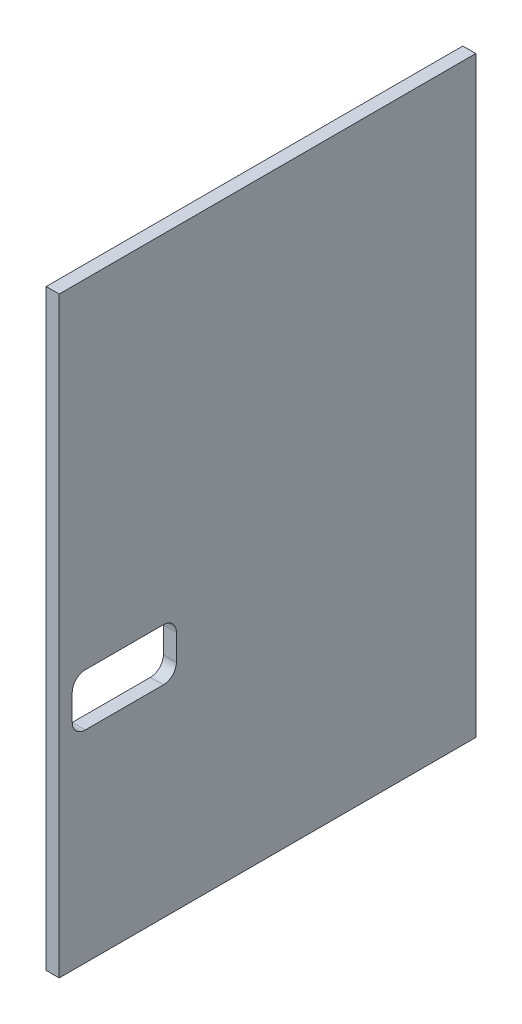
ISO-10303-21;
HEADER;
FILE_DESCRIPTION(('STEP AP214'),'2;1');
FILE_NAME('part.step','',(''),(''),'','','');
FILE_SCHEMA(('AUTOMOTIVE_DESIGN { 1 0 10303 214 1 1 1 1 }'));
ENDSEC;
DATA;
#1=APPLICATION_CONTEXT('core data for automotive mechanical design processes');
#2=APPLICATION_PROTOCOL_DEFINITION('international standard','automotive_design',2000,#1);
#3=PRODUCT_CONTEXT('',#1,'mechanical');
#4=PRODUCT('Part','Part','',(#3));
#5=PRODUCT_RELATED_PRODUCT_CATEGORY('part','',(#4));
#6=PRODUCT_DEFINITION_FORMATION('','',#4);
#7=PRODUCT_DEFINITION_CONTEXT('part definition',#1,'design');
#8=PRODUCT_DEFINITION('design','',#6,#7);
#9=PRODUCT_DEFINITION_SHAPE('','',#8);
#10=(LENGTH_UNIT() NAMED_UNIT(*) SI_UNIT(.MILLI.,.METRE.));
#11=(NAMED_UNIT(*) PLANE_ANGLE_UNIT() SI_UNIT($,.RADIAN.));
#12=(NAMED_UNIT(*) SI_UNIT($,.STERADIAN.) SOLID_ANGLE_UNIT());
#13=UNCERTAINTY_MEASURE_WITH_UNIT(LENGTH_MEASURE(1.E-05),#10,'distance_accuracy_value','');
#14=(GEOMETRIC_REPRESENTATION_CONTEXT(3) GLOBAL_UNCERTAINTY_ASSIGNED_CONTEXT((#13)) GLOBAL_UNIT_ASSIGNED_CONTEXT((#10,
#11,#12)) REPRESENTATION_CONTEXT('',''));
#15=CARTESIAN_POINT('',(0.,0.,0.));
#16=DIRECTION('',(0.,0.,1.));
#17=DIRECTION('',(1.,0.,0.));
#18=AXIS2_PLACEMENT_3D('',#15,#16,#17);
#19=CARTESIAN_POINT('',(25.4,0.,0.));
#20=DIRECTION('',(0.,0.,-1.));
#21=DIRECTION('',(-1.,0.,0.));
#22=AXIS2_PLACEMENT_3D('',#19,#20,#21);
#23=PLANE('',#22);
#24=DIRECTION('',(0.,-1.,0.));
#25=VECTOR('',#24,1.);
#26=CARTESIAN_POINT('',(0.,0.,0.));
#27=LINE('',#26,#25);
#28=CARTESIAN_POINT('',(0.,1155.7,0.));
#29=VERTEX_POINT('',#28);
#30=CARTESIAN_POINT('',(0.,0.,0.));
#31=VERTEX_POINT('',#30);
#32=EDGE_CURVE('E128',#29,#31,#27,.T.);
#33=ORIENTED_EDGE('',*,*,#32,.T.);
#34=DIRECTION('',(-1.,0.,0.));
#35=VECTOR('',#34,1.);
#36=CARTESIAN_POINT('',(25.4,0.,0.));
#37=LINE('',#36,#35);
#38=CARTESIAN_POINT('',(25.4,0.,0.));
#39=VERTEX_POINT('',#38);
#40=EDGE_CURVE('E11',#39,#31,#37,.T.);
#41=ORIENTED_EDGE('',*,*,#40,.F.);
#42=DIRECTION('',(0.,-1.,0.));
#43=VECTOR('',#42,1.);
#44=CARTESIAN_POINT('',(25.4,0.,0.));
#45=LINE('',#44,#43);
#46=CARTESIAN_POINT('',(25.4,1155.7,0.));
#47=VERTEX_POINT('',#46);
#48=EDGE_CURVE('E178',#47,#39,#45,.T.);
#49=ORIENTED_EDGE('',*,*,#48,.F.);
#50=DIRECTION('',(-1.,0.,0.));
#51=VECTOR('',#50,1.);
#52=CARTESIAN_POINT('',(25.4,1155.7,0.));
#53=LINE('',#52,#51);
#54=EDGE_CURVE('E188',#47,#29,#53,.T.);
#55=ORIENTED_EDGE('',*,*,#54,.T.);
#56=EDGE_LOOP('',(#33,#41,#49,#55));
#57=FACE_BOUND('',#56,.T.);
#58=ADVANCED_FACE('F34',(#57),#23,.F.);
#59=CARTESIAN_POINT('',(25.4,0.,0.));
#60=DIRECTION('',(0.,1.,0.));
#61=DIRECTION('',(0.,0.,1.));
#62=AXIS2_PLACEMENT_3D('',#59,#60,#61);
#63=PLANE('',#62);
#64=DIRECTION('',(0.,0.,-1.));
#65=VECTOR('',#64,1.);
#66=CARTESIAN_POINT('',(0.,0.,0.));
#67=LINE('',#66,#65);
#68=CARTESIAN_POINT('',(0.,0.,-812.8));
#69=VERTEX_POINT('',#68);
#70=EDGE_CURVE('E191',#31,#69,#67,.T.);
#71=ORIENTED_EDGE('',*,*,#70,.T.);
#72=DIRECTION('',(-1.,0.,0.));
#73=VECTOR('',#72,1.);
#74=CARTESIAN_POINT('',(25.4,0.,-812.8));
#75=LINE('',#74,#73);
#76=CARTESIAN_POINT('',(25.4,0.,-812.8));
#77=VERTEX_POINT('',#76);
#78=EDGE_CURVE('E41',#77,#69,#75,.T.);
#79=ORIENTED_EDGE('',*,*,#78,.F.);
#80=DIRECTION('',(0.,0.,-1.));
#81=VECTOR('',#80,1.);
#82=CARTESIAN_POINT('',(25.4,0.,0.));
#83=LINE('',#82,#81);
#84=EDGE_CURVE('E181',#39,#77,#83,.T.);
#85=ORIENTED_EDGE('',*,*,#84,.F.);
#86=ORIENTED_EDGE('',*,*,#40,.T.);
#87=EDGE_LOOP('',(#71,#79,#85,#86));
#88=FACE_BOUND('',#87,.T.);
#89=ADVANCED_FACE('F219',(#88),#63,.F.);
#90=CARTESIAN_POINT('',(25.4,0.,-812.8));
#91=DIRECTION('',(0.,0.,1.));
#92=DIRECTION('',(1.,0.,0.));
#93=AXIS2_PLACEMENT_3D('',#90,#91,#92);
#94=PLANE('',#93);
#95=DIRECTION('',(0.,1.,0.));
#96=VECTOR('',#95,1.);
#97=CARTESIAN_POINT('',(0.,0.,-812.8));
#98=LINE('',#97,#96);
#99=CARTESIAN_POINT('',(0.,1155.7,-812.8));
#100=VERTEX_POINT('',#99);
#101=EDGE_CURVE('E193',#69,#100,#98,.T.);
#102=ORIENTED_EDGE('',*,*,#101,.T.);
#103=DIRECTION('',(-1.,0.,0.));
#104=VECTOR('',#103,1.);
#105=CARTESIAN_POINT('',(25.4,1155.7,-812.8));
#106=LINE('',#105,#104);
#107=CARTESIAN_POINT('',(25.4,1155.7,-812.8));
#108=VERTEX_POINT('',#107);
#109=EDGE_CURVE('E198',#108,#100,#106,.T.);
#110=ORIENTED_EDGE('',*,*,#109,.F.);
#111=DIRECTION('',(0.,1.,0.));
#112=VECTOR('',#111,1.);
#113=CARTESIAN_POINT('',(25.4,0.,-812.8));
#114=LINE('',#113,#112);
#115=EDGE_CURVE('E184',#77,#108,#114,.T.);
#116=ORIENTED_EDGE('',*,*,#115,.F.);
#117=ORIENTED_EDGE('',*,*,#78,.T.);
#118=EDGE_LOOP('',(#102,#110,#116,#117));
#119=FACE_BOUND('',#118,.T.);
#120=ADVANCED_FACE('F205',(#119),#94,.F.);
#121=CARTESIAN_POINT('',(25.4,1155.7,0.));
#122=DIRECTION('',(0.,-1.,0.));
#123=DIRECTION('',(0.,0.,-1.));
#124=AXIS2_PLACEMENT_3D('',#121,#122,#123);
#125=PLANE('',#124);
#126=DIRECTION('',(0.,0.,1.));
#127=VECTOR('',#126,1.);
#128=CARTESIAN_POINT('',(0.,1155.7,0.));
#129=LINE('',#128,#127);
#130=EDGE_CURVE('E182',#100,#29,#129,.T.);
#131=ORIENTED_EDGE('',*,*,#130,.T.);
#132=ORIENTED_EDGE('',*,*,#54,.F.);
#133=DIRECTION('',(0.,0.,1.));
#134=VECTOR('',#133,1.);
#135=CARTESIAN_POINT('',(25.4,1155.7,0.));
#136=LINE('',#135,#134);
#137=EDGE_CURVE('E186',#108,#47,#136,.T.);
#138=ORIENTED_EDGE('',*,*,#137,.F.);
#139=ORIENTED_EDGE('',*,*,#109,.T.);
#140=EDGE_LOOP('',(#131,#132,#138,#139));
#141=FACE_BOUND('',#140,.T.);
#142=ADVANCED_FACE('F212',(#141),#125,.F.);
#143=CARTESIAN_POINT('',(25.4,0.,0.));
#144=DIRECTION('',(-1.,0.,0.));
#145=DIRECTION('',(0.,0.,1.));
#146=AXIS2_PLACEMENT_3D('',#143,#144,#145);
#147=PLANE('',#146);
#148=DIRECTION('',(0.,0.,1.));
#149=VECTOR('',#148,1.);
#150=CARTESIAN_POINT('',(25.4,495.300000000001,-50.8));
#151=LINE('',#150,#149);
#152=CARTESIAN_POINT('',(25.4,495.300000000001,-203.2));
#153=VERTEX_POINT('',#152);
#154=CARTESIAN_POINT('',(25.4,495.300000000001,-50.8));
#155=VERTEX_POINT('',#154);
#156=EDGE_CURVE('E142',#153,#155,#151,.T.);
#157=ORIENTED_EDGE('',*,*,#156,.F.);
#158=CARTESIAN_POINT('',(25.4,469.900000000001,-203.2));
#159=DIRECTION('',(1.,0.,0.));
#160=DIRECTION('',(0.,0.,1.));
#161=AXIS2_PLACEMENT_3D('',#158,#159,#160);
#162=CIRCLE('',#161,25.4);
#163=CARTESIAN_POINT('',(25.4,469.900000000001,-228.6));
#164=VERTEX_POINT('',#163);
#165=EDGE_CURVE('E48',#164,#153,#162,.T.);
#166=ORIENTED_EDGE('',*,*,#165,.F.);
#167=DIRECTION('',(0.,1.,0.));
#168=VECTOR('',#167,1.);
#169=CARTESIAN_POINT('',(25.4,469.900000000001,-228.6));
#170=LINE('',#169,#168);
#171=CARTESIAN_POINT('',(25.4,419.100000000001,-228.6));
#172=VERTEX_POINT('',#171);
#173=EDGE_CURVE('E134',#172,#164,#170,.T.);
#174=ORIENTED_EDGE('',*,*,#173,.F.);
#175=CARTESIAN_POINT('',(25.4,419.100000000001,-203.2));
#176=DIRECTION('',(1.,0.,0.));
#177=DIRECTION('',(0.,0.,-1.));
#178=AXIS2_PLACEMENT_3D('',#175,#176,#177);
#179=CIRCLE('',#178,25.4);
#180=CARTESIAN_POINT('',(25.4,393.700000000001,-203.2));
#181=VERTEX_POINT('',#180);
#182=EDGE_CURVE('E161',#181,#172,#179,.T.);
#183=ORIENTED_EDGE('',*,*,#182,.F.);
#184=DIRECTION('',(0.,0.,-1.));
#185=VECTOR('',#184,1.);
#186=CARTESIAN_POINT('',(25.4,393.700000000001,-50.8));
#187=LINE('',#186,#185);
#188=CARTESIAN_POINT('',(25.4,393.700000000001,-50.8));
#189=VERTEX_POINT('',#188);
#190=EDGE_CURVE('E158',#189,#181,#187,.T.);
#191=ORIENTED_EDGE('',*,*,#190,.F.);
#192=CARTESIAN_POINT('',(25.4,419.100000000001,-50.8));
#193=DIRECTION('',(1.,0.,0.));
#194=DIRECTION('',(0.,0.,-1.));
#195=AXIS2_PLACEMENT_3D('',#192,#193,#194);
#196=CIRCLE('',#195,25.4);
#197=CARTESIAN_POINT('',(25.4,419.100000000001,-25.4));
#198=VERTEX_POINT('',#197);
#199=EDGE_CURVE('E155',#198,#189,#196,.T.);
#200=ORIENTED_EDGE('',*,*,#199,.F.);
#201=DIRECTION('',(0.,-1.,0.));
#202=VECTOR('',#201,1.);
#203=CARTESIAN_POINT('',(25.4,469.900000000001,-25.4));
#204=LINE('',#203,#202);
#205=CARTESIAN_POINT('',(25.4,469.900000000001,-25.4));
#206=VERTEX_POINT('',#205);
#207=EDGE_CURVE('E152',#206,#198,#204,.T.);
#208=ORIENTED_EDGE('',*,*,#207,.F.);
#209=CARTESIAN_POINT('',(25.4,469.900000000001,-50.8));
#210=DIRECTION('',(1.,0.,0.));
#211=DIRECTION('',(0.,0.,-1.));
#212=AXIS2_PLACEMENT_3D('',#209,#210,#211);
#213=CIRCLE('',#212,25.4);
#214=EDGE_CURVE('E149',#155,#206,#213,.T.);
#215=ORIENTED_EDGE('',*,*,#214,.F.);
#216=EDGE_LOOP('',(#157,#166,#174,#183,#191,#200,#208,#215));
#217=FACE_BOUND('',#216,.T.);
#218=ORIENTED_EDGE('',*,*,#48,.T.);
#219=ORIENTED_EDGE('',*,*,#84,.T.);
#220=ORIENTED_EDGE('',*,*,#115,.T.);
#221=ORIENTED_EDGE('',*,*,#137,.T.);
#222=EDGE_LOOP('',(#218,#219,#220,#221));
#223=FACE_BOUND('',#222,.T.);
#224=ADVANCED_FACE('F218',(#217,#223),#147,.F.);
#225=CARTESIAN_POINT('',(0.,0.,0.));
#226=DIRECTION('',(-1.,0.,0.));
#227=DIRECTION('',(0.,0.,1.));
#228=AXIS2_PLACEMENT_3D('',#225,#226,#227);
#229=PLANE('',#228);
#230=CARTESIAN_POINT('',(0.,469.900000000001,-203.2));
#231=DIRECTION('',(-1.,0.,0.));
#232=DIRECTION('',(0.,0.,1.));
#233=AXIS2_PLACEMENT_3D('',#230,#231,#232);
#234=CIRCLE('',#233,25.4);
#235=CARTESIAN_POINT('',(0.,469.900000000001,-228.6));
#236=VERTEX_POINT('',#235);
#237=CARTESIAN_POINT('',(0.,495.300000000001,-203.2));
#238=VERTEX_POINT('',#237);
#239=EDGE_CURVE('E132',#236,#238,#234,.F.);
#240=ORIENTED_EDGE('',*,*,#239,.T.);
#241=DIRECTION('',(0.,0.,1.));
#242=VECTOR('',#241,1.);
#243=CARTESIAN_POINT('',(0.,495.300000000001,-50.8));
#244=LINE('',#243,#242);
#245=CARTESIAN_POINT('',(0.,495.300000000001,-50.8));
#246=VERTEX_POINT('',#245);
#247=EDGE_CURVE('E121',#238,#246,#244,.T.);
#248=ORIENTED_EDGE('',*,*,#247,.T.);
#249=CARTESIAN_POINT('',(0.,469.900000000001,-50.8));
#250=DIRECTION('',(-1.,0.,0.));
#251=DIRECTION('',(0.,0.,1.));
#252=AXIS2_PLACEMENT_3D('',#249,#250,#251);
#253=CIRCLE('',#252,25.4);
#254=CARTESIAN_POINT('',(0.,469.900000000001,-25.4));
#255=VERTEX_POINT('',#254);
#256=EDGE_CURVE('E272',#246,#255,#253,.F.);
#257=ORIENTED_EDGE('',*,*,#256,.T.);
#258=DIRECTION('',(0.,-1.,0.));
#259=VECTOR('',#258,1.);
#260=CARTESIAN_POINT('',(0.,469.900000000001,-25.4));
#261=LINE('',#260,#259);
#262=CARTESIAN_POINT('',(0.,419.100000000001,-25.4));
#263=VERTEX_POINT('',#262);
#264=EDGE_CURVE('E274',#255,#263,#261,.T.);
#265=ORIENTED_EDGE('',*,*,#264,.T.);
#266=CARTESIAN_POINT('',(0.,419.100000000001,-50.8));
#267=DIRECTION('',(-1.,0.,0.));
#268=DIRECTION('',(0.,0.,1.));
#269=AXIS2_PLACEMENT_3D('',#266,#267,#268);
#270=CIRCLE('',#269,25.4);
#271=CARTESIAN_POINT('',(0.,393.700000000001,-50.8));
#272=VERTEX_POINT('',#271);
#273=EDGE_CURVE('E276',#263,#272,#270,.F.);
#274=ORIENTED_EDGE('',*,*,#273,.T.);
#275=DIRECTION('',(0.,0.,-1.));
#276=VECTOR('',#275,1.);
#277=CARTESIAN_POINT('',(0.,393.700000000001,-50.8));
#278=LINE('',#277,#276);
#279=CARTESIAN_POINT('',(0.,393.700000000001,-203.2));
#280=VERTEX_POINT('',#279);
#281=EDGE_CURVE('E281',#272,#280,#278,.T.);
#282=ORIENTED_EDGE('',*,*,#281,.T.);
#283=CARTESIAN_POINT('',(0.,419.100000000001,-203.2));
#284=DIRECTION('',(-1.,0.,0.));
#285=DIRECTION('',(0.,0.,1.));
#286=AXIS2_PLACEMENT_3D('',#283,#284,#285);
#287=CIRCLE('',#286,25.4);
#288=CARTESIAN_POINT('',(0.,419.100000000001,-228.6));
#289=VERTEX_POINT('',#288);
#290=EDGE_CURVE('E144',#280,#289,#287,.F.);
#291=ORIENTED_EDGE('',*,*,#290,.T.);
#292=DIRECTION('',(0.,1.,0.));
#293=VECTOR('',#292,1.);
#294=CARTESIAN_POINT('',(0.,469.900000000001,-228.6));
#295=LINE('',#294,#293);
#296=EDGE_CURVE('E140',#289,#236,#295,.T.);
#297=ORIENTED_EDGE('',*,*,#296,.T.);
#298=EDGE_LOOP('',(#240,#248,#257,#265,#274,#282,#291,#297));
#299=FACE_BOUND('',#298,.T.);
#300=ORIENTED_EDGE('',*,*,#32,.F.);
#301=ORIENTED_EDGE('',*,*,#130,.F.);
#302=ORIENTED_EDGE('',*,*,#101,.F.);
#303=ORIENTED_EDGE('',*,*,#70,.F.);
#304=EDGE_LOOP('',(#300,#301,#302,#303));
#305=FACE_BOUND('',#304,.T.);
#306=ADVANCED_FACE('F137',(#299,#305),#229,.T.);
#307=CARTESIAN_POINT('',(-0.001000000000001,469.900000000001,-203.2));
#308=DIRECTION('',(1.,0.,0.));
#309=DIRECTION('',(0.,0.,-1.));
#310=AXIS2_PLACEMENT_3D('',#307,#308,#309);
#311=CYLINDRICAL_SURFACE('',#310,25.4);
#312=DIRECTION('',(1.,0.,0.));
#313=VECTOR('',#312,1.);
#314=CARTESIAN_POINT('',(-0.001000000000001,469.900000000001,-228.6));
#315=LINE('',#314,#313);
#316=EDGE_CURVE('E129',#236,#164,#315,.T.);
#317=ORIENTED_EDGE('',*,*,#316,.T.);
#318=ORIENTED_EDGE('',*,*,#165,.T.);
#319=DIRECTION('',(1.,0.,0.));
#320=VECTOR('',#319,1.);
#321=CARTESIAN_POINT('',(-0.001000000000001,495.300000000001,-203.2));
#322=LINE('',#321,#320);
#323=EDGE_CURVE('E123',#238,#153,#322,.T.);
#324=ORIENTED_EDGE('',*,*,#323,.F.);
#325=ORIENTED_EDGE('',*,*,#239,.F.);
#326=EDGE_LOOP('',(#317,#318,#324,#325));
#327=FACE_BOUND('',#326,.T.);
#328=ADVANCED_FACE('F131',(#327),#311,.F.);
#329=CARTESIAN_POINT('',(-0.001000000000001,469.900000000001,-228.6));
#330=DIRECTION('',(0.,0.,-1.));
#331=DIRECTION('',(0.,1.,0.));
#332=AXIS2_PLACEMENT_3D('',#329,#330,#331);
#333=PLANE('',#332);
#334=DIRECTION('',(1.,0.,0.));
#335=VECTOR('',#334,1.);
#336=CARTESIAN_POINT('',(-0.001000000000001,419.100000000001,-228.6));
#337=LINE('',#336,#335);
#338=EDGE_CURVE('E167',#289,#172,#337,.T.);
#339=ORIENTED_EDGE('',*,*,#338,.T.);
#340=ORIENTED_EDGE('',*,*,#173,.T.);
#341=ORIENTED_EDGE('',*,*,#316,.F.);
#342=ORIENTED_EDGE('',*,*,#296,.F.);
#343=EDGE_LOOP('',(#339,#340,#341,#342));
#344=FACE_BOUND('',#343,.T.);
#345=ADVANCED_FACE('F236',(#344),#333,.F.);
#346=CARTESIAN_POINT('',(-0.001000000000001,419.100000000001,-203.2));
#347=DIRECTION('',(1.,0.,0.));
#348=DIRECTION('',(0.,0.,-1.));
#349=AXIS2_PLACEMENT_3D('',#346,#347,#348);
#350=CYLINDRICAL_SURFACE('',#349,25.4);
#351=DIRECTION('',(1.,0.,0.));
#352=VECTOR('',#351,1.);
#353=CARTESIAN_POINT('',(-0.001000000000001,393.700000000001,-203.2));
#354=LINE('',#353,#352);
#355=EDGE_CURVE('E169',#280,#181,#354,.T.);
#356=ORIENTED_EDGE('',*,*,#355,.T.);
#357=ORIENTED_EDGE('',*,*,#182,.T.);
#358=ORIENTED_EDGE('',*,*,#338,.F.);
#359=ORIENTED_EDGE('',*,*,#290,.F.);
#360=EDGE_LOOP('',(#356,#357,#358,#359));
#361=FACE_BOUND('',#360,.T.);
#362=ADVANCED_FACE('F254',(#361),#350,.F.);
#363=CARTESIAN_POINT('',(-0.001000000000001,393.700000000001,-50.8));
#364=DIRECTION('',(0.,-1.,0.));
#365=DIRECTION('',(0.,0.,-1.));
#366=AXIS2_PLACEMENT_3D('',#363,#364,#365);
#367=PLANE('',#366);
#368=DIRECTION('',(1.,0.,0.));
#369=VECTOR('',#368,1.);
#370=CARTESIAN_POINT('',(-0.001000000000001,393.700000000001,-50.8));
#371=LINE('',#370,#369);
#372=EDGE_CURVE('E171',#272,#189,#371,.T.);
#373=ORIENTED_EDGE('',*,*,#372,.T.);
#374=ORIENTED_EDGE('',*,*,#190,.T.);
#375=ORIENTED_EDGE('',*,*,#355,.F.);
#376=ORIENTED_EDGE('',*,*,#281,.F.);
#377=EDGE_LOOP('',(#373,#374,#375,#376));
#378=FACE_BOUND('',#377,.T.);
#379=ADVANCED_FACE('F250',(#378),#367,.F.);
#380=CARTESIAN_POINT('',(-0.001000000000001,419.100000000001,-50.8));
#381=DIRECTION('',(1.,0.,0.));
#382=DIRECTION('',(0.,0.,-1.));
#383=AXIS2_PLACEMENT_3D('',#380,#381,#382);
#384=CYLINDRICAL_SURFACE('',#383,25.4);
#385=DIRECTION('',(1.,0.,0.));
#386=VECTOR('',#385,1.);
#387=CARTESIAN_POINT('',(-0.001000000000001,419.100000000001,-25.4));
#388=LINE('',#387,#386);
#389=EDGE_CURVE('E173',#263,#198,#388,.T.);
#390=ORIENTED_EDGE('',*,*,#389,.T.);
#391=ORIENTED_EDGE('',*,*,#199,.T.);
#392=ORIENTED_EDGE('',*,*,#372,.F.);
#393=ORIENTED_EDGE('',*,*,#273,.F.);
#394=EDGE_LOOP('',(#390,#391,#392,#393));
#395=FACE_BOUND('',#394,.T.);
#396=ADVANCED_FACE('F246',(#395),#384,.F.);
#397=CARTESIAN_POINT('',(-0.001000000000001,469.900000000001,-25.4));
#398=DIRECTION('',(0.,0.,1.));
#399=DIRECTION('',(0.,-1.,0.));
#400=AXIS2_PLACEMENT_3D('',#397,#398,#399);
#401=PLANE('',#400);
#402=DIRECTION('',(1.,0.,0.));
#403=VECTOR('',#402,1.);
#404=CARTESIAN_POINT('',(-0.001000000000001,469.900000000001,-25.4));
#405=LINE('',#404,#403);
#406=EDGE_CURVE('E175',#255,#206,#405,.T.);
#407=ORIENTED_EDGE('',*,*,#406,.T.);
#408=ORIENTED_EDGE('',*,*,#207,.T.);
#409=ORIENTED_EDGE('',*,*,#389,.F.);
#410=ORIENTED_EDGE('',*,*,#264,.F.);
#411=EDGE_LOOP('',(#407,#408,#409,#410));
#412=FACE_BOUND('',#411,.T.);
#413=ADVANCED_FACE('F242',(#412),#401,.F.);
#414=CARTESIAN_POINT('',(-0.001000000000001,469.900000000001,-50.8));
#415=DIRECTION('',(1.,0.,0.));
#416=DIRECTION('',(0.,0.,-1.));
#417=AXIS2_PLACEMENT_3D('',#414,#415,#416);
#418=CYLINDRICAL_SURFACE('',#417,25.4);
#419=DIRECTION('',(1.,0.,0.));
#420=VECTOR('',#419,1.);
#421=CARTESIAN_POINT('',(-0.001000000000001,495.300000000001,-50.8));
#422=LINE('',#421,#420);
#423=EDGE_CURVE('E56',#246,#155,#422,.T.);
#424=ORIENTED_EDGE('',*,*,#423,.T.);
#425=ORIENTED_EDGE('',*,*,#214,.T.);
#426=ORIENTED_EDGE('',*,*,#406,.F.);
#427=ORIENTED_EDGE('',*,*,#256,.F.);
#428=EDGE_LOOP('',(#424,#425,#426,#427));
#429=FACE_BOUND('',#428,.T.);
#430=ADVANCED_FACE('F239',(#429),#418,.F.);
#431=CARTESIAN_POINT('',(-0.001000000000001,495.300000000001,-50.8));
#432=DIRECTION('',(0.,1.,0.));
#433=DIRECTION('',(0.,0.,1.));
#434=AXIS2_PLACEMENT_3D('',#431,#432,#433);
#435=PLANE('',#434);
#436=ORIENTED_EDGE('',*,*,#323,.T.);
#437=ORIENTED_EDGE('',*,*,#156,.T.);
#438=ORIENTED_EDGE('',*,*,#423,.F.);
#439=ORIENTED_EDGE('',*,*,#247,.F.);
#440=EDGE_LOOP('',(#436,#437,#438,#439));
#441=FACE_BOUND('',#440,.T.);
#442=ADVANCED_FACE('F122',(#441),#435,.F.);
#443=CLOSED_SHELL('',(#58,#89,#120,#142,#224,#306,#328,#345,#362,#379,#396,#413,#430,#442));
#444=MANIFOLD_SOLID_BREP('B2',#443);
#445=ADVANCED_BREP_SHAPE_REPRESENTATION('',(#18,#444),#14);
#446=SHAPE_DEFINITION_REPRESENTATION(#9,#445);
ENDSEC;
END-ISO-10303-21;
